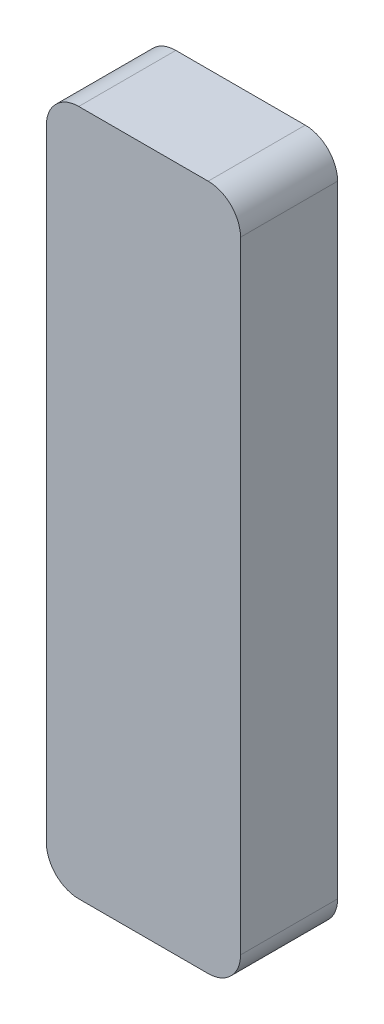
from build123d import *

# Parameters (mm, degrees)
BOSS_EXTRUDE1_DEPTH = 3


with BuildPart() as part:
    # Sketch1 → Boss-Extrude1 (new body)
    with BuildSketch(Plane.XY):
        with BuildLine():
            Line((-2, 10.605), (2, 10.605))
            ThreePointArc((2, 10.605), (2.707106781, 10.312106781), (3, 9.605))
            Line((3, 9.605), (3, -9.605))
            ThreePointArc((3, -9.605), (2.707106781, -10.312106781), (2, -10.605))
            Line((2, -10.605), (-2, -10.605))
            ThreePointArc((-2, -10.605), (-2.707106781, -10.312106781), (-3, -9.605))
            Line((-3, -9.605), (-3, 9.605))
            ThreePointArc((-3, 9.605), (-2.707106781, 10.312106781), (-2, 10.605))
        make_face()
    extrude(amount=BOSS_EXTRUDE1_DEPTH)


solid = part.part
